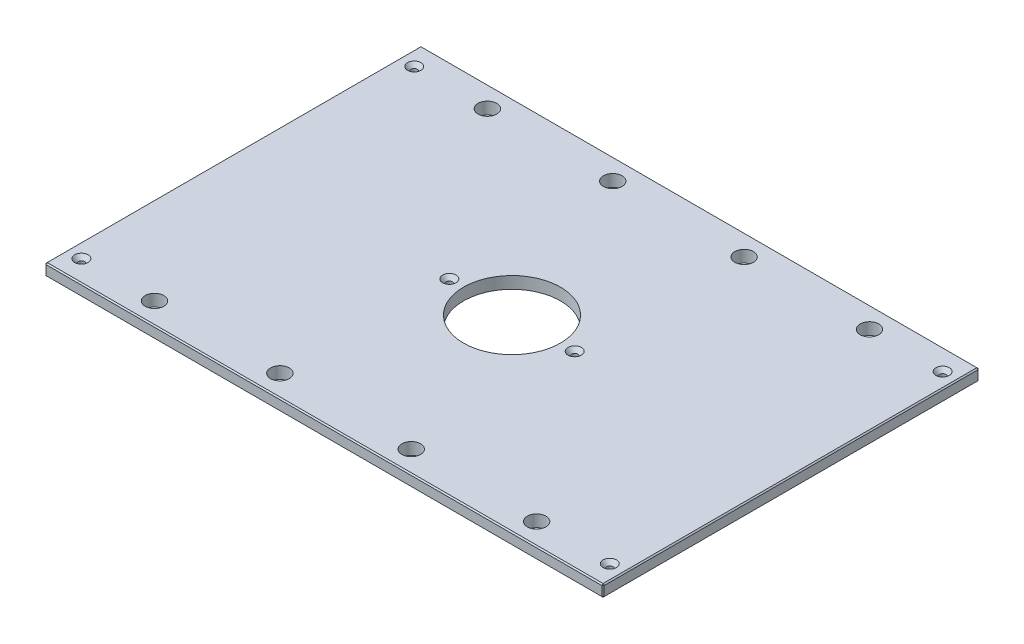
from build123d import *

# Parameters (mm, degrees)
SKETCH1_W                                        = 593.725
SKETCH1_H                                        = 400.05
BOSS_EXTRUDE1_DEPTH                              = 12.7
SKETCH13_R                                       = 51.562
CUT_EXTRUDE6_DEPTH                               = 359.187987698
F_25_32_0_78125_DIAMETER_HOLE1_D                 = 19.84375
CHAMFER2_SIZE                                    = 1.27
CSK_FOR_1_4_FLAT_HEAD_MACHINE_SCREW1_D           = 6.7564
CSK_FOR_1_4_FLAT_HEAD_MACHINE_SCREW1_CSINK_D     = 14.2748
CSK_FOR_1_4_FLAT_HEAD_MACHINE_SCREW1_CSINK_ANGLE = 82


with BuildPart() as part:
    # Sketch1 → Boss-Extrude1 (new body)
    with BuildSketch(Plane(origin=(0, 0, 0), x_dir=(1, 0, 0), z_dir=(0, 1, 0))):
        Rectangle(SKETCH1_W, SKETCH1_H)
    extrude(amount=BOSS_EXTRUDE1_DEPTH)

    # Sketch13 → Cut-Extrude6 (cut, through all)
    with BuildSketch(Plane(origin=(0, 12.7, 0), x_dir=(1, 0, 0), z_dir=(0, 1, 0))):
        with Locations(Location((0, 0, 0), (0, 0, 270))):
            Circle(SKETCH13_R)
    extrude(amount=-CUT_EXTRUDE6_DEPTH, mode=Mode.SUBTRACT)

    # 25_32 _0.78125_ Diameter Hole1 (through all)
    with Locations(Plane(origin=(0, 12.7, 0), x_dir=(1, 0, 0), z_dir=(0, 1, 0))):
        with Locations((203.2, 177.00498), (-203.2, 177.00498), (203.2, -177.00498), (-203.2, -177.00498), (-69.85, 177.00498), (69.85, 177.00498), (69.85, -177.00498), (-69.85, -177.00498)):
            Hole(F_25_32_0_78125_DIAMETER_HOLE1_D / 2)

    # Chamfer2
    chamfer2_edges = [part.edges().sort_by_distance(p)[0] for p in [
        (296.8625, 12.7, 0),
        (0, 12.7, -200.025),
        (-296.8625, 12.7, 0),
        (0, 0, -200.025),
        (296.8625, 0, 0),
        (0, 0, 200.025),
        (-296.8625, 0, 0),
        (0, 12.7, 200.025),
        (-296.8625, 6.35, -200.025),
        (296.8625, 6.35, -200.025),
        (296.8625, 6.35, 200.025),
        (-296.8625, 6.35, 200.025),
    ]]
    chamfer(chamfer2_edges, length=CHAMFER2_SIZE)

    # CSK for 1_4 Flat Head Machine Screw1 (through all)
    with Locations(Plane(origin=(0, 12.7, 0), x_dir=(1, 0, 0), z_dir=(0, 1, 0))):
        with Locations((280.9875, 177.00498), (280.9875, -177.00498), (-280.9875, -177.00498), (-66.675, 0), (66.675, 0), (-280.9875, 177.00498), (-203.2, 177.00498), (-203.2, -177.00498)):
            CounterSinkHole(CSK_FOR_1_4_FLAT_HEAD_MACHINE_SCREW1_D / 2, CSK_FOR_1_4_FLAT_HEAD_MACHINE_SCREW1_CSINK_D / 2, counter_sink_angle=CSK_FOR_1_4_FLAT_HEAD_MACHINE_SCREW1_CSINK_ANGLE)


solid = part.part
